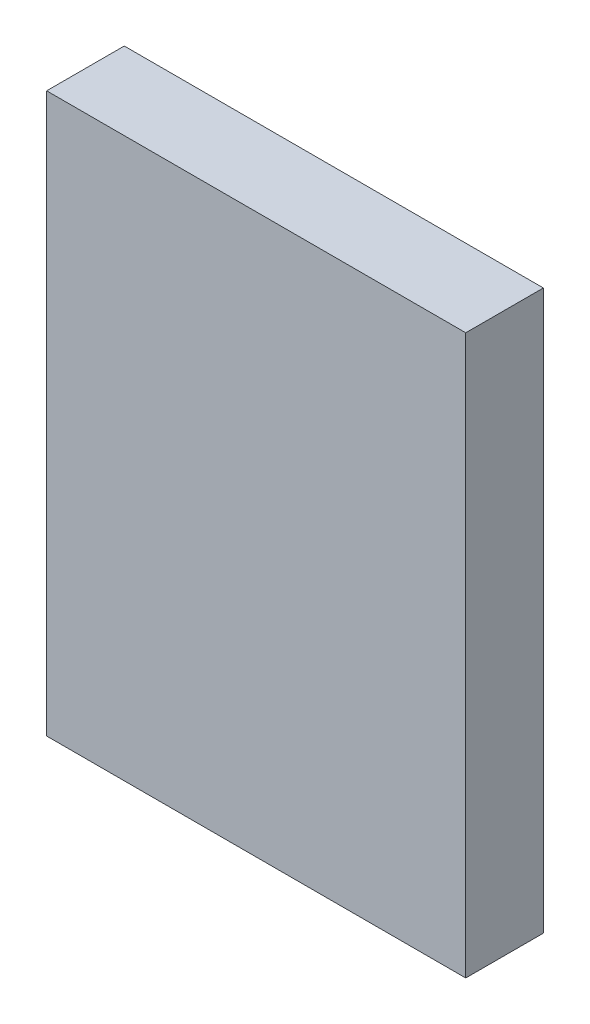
ISO-10303-21;
HEADER;
FILE_DESCRIPTION(('STEP AP214'),'2;1');
FILE_NAME('part.step','',(''),(''),'','','');
FILE_SCHEMA(('AUTOMOTIVE_DESIGN { 1 0 10303 214 1 1 1 1 }'));
ENDSEC;
DATA;
#1=APPLICATION_CONTEXT('core data for automotive mechanical design processes');
#2=APPLICATION_PROTOCOL_DEFINITION('international standard','automotive_design',2000,#1);
#3=PRODUCT_CONTEXT('',#1,'mechanical');
#4=PRODUCT('Part','Part','',(#3));
#5=PRODUCT_RELATED_PRODUCT_CATEGORY('part','',(#4));
#6=PRODUCT_DEFINITION_FORMATION('','',#4);
#7=PRODUCT_DEFINITION_CONTEXT('part definition',#1,'design');
#8=PRODUCT_DEFINITION('design','',#6,#7);
#9=PRODUCT_DEFINITION_SHAPE('','',#8);
#10=(LENGTH_UNIT() NAMED_UNIT(*) SI_UNIT(.MILLI.,.METRE.));
#11=(NAMED_UNIT(*) PLANE_ANGLE_UNIT() SI_UNIT($,.RADIAN.));
#12=(NAMED_UNIT(*) SI_UNIT($,.STERADIAN.) SOLID_ANGLE_UNIT());
#13=UNCERTAINTY_MEASURE_WITH_UNIT(LENGTH_MEASURE(1.E-05),#10,'distance_accuracy_value','');
#14=(GEOMETRIC_REPRESENTATION_CONTEXT(3) GLOBAL_UNCERTAINTY_ASSIGNED_CONTEXT((#13)) GLOBAL_UNIT_ASSIGNED_CONTEXT((#10,
#11,#12)) REPRESENTATION_CONTEXT('',''));
#15=CARTESIAN_POINT('',(0.,0.,0.));
#16=DIRECTION('',(0.,0.,1.));
#17=DIRECTION('',(1.,0.,0.));
#18=AXIS2_PLACEMENT_3D('',#15,#16,#17);
#19=CARTESIAN_POINT('',(-13.5,18.,5.));
#20=DIRECTION('',(1.,0.,0.));
#21=DIRECTION('',(0.,1.,0.));
#22=AXIS2_PLACEMENT_3D('',#19,#20,#21);
#23=PLANE('',#22);
#24=DIRECTION('',(0.,-1.,0.));
#25=VECTOR('',#24,1.);
#26=CARTESIAN_POINT('',(-13.5,18.,0.));
#27=LINE('',#26,#25);
#28=CARTESIAN_POINT('',(-13.5,18.,0.));
#29=VERTEX_POINT('',#28);
#30=CARTESIAN_POINT('',(-13.5,-18.,0.));
#31=VERTEX_POINT('',#30);
#32=EDGE_CURVE('E97',#29,#31,#27,.T.);
#33=ORIENTED_EDGE('',*,*,#32,.T.);
#34=DIRECTION('',(0.,0.,-1.));
#35=VECTOR('',#34,1.);
#36=CARTESIAN_POINT('',(-13.5,-18.,5.));
#37=LINE('',#36,#35);
#38=CARTESIAN_POINT('',(-13.5,-18.,5.));
#39=VERTEX_POINT('',#38);
#40=EDGE_CURVE('E11',#39,#31,#37,.T.);
#41=ORIENTED_EDGE('',*,*,#40,.F.);
#42=DIRECTION('',(0.,-1.,0.));
#43=VECTOR('',#42,1.);
#44=CARTESIAN_POINT('',(-13.5,18.,5.));
#45=LINE('',#44,#43);
#46=CARTESIAN_POINT('',(-13.5,18.,5.));
#47=VERTEX_POINT('',#46);
#48=EDGE_CURVE('E85',#47,#39,#45,.T.);
#49=ORIENTED_EDGE('',*,*,#48,.F.);
#50=DIRECTION('',(0.,0.,-1.));
#51=VECTOR('',#50,1.);
#52=CARTESIAN_POINT('',(-13.5,18.,5.));
#53=LINE('',#52,#51);
#54=EDGE_CURVE('E93',#47,#29,#53,.T.);
#55=ORIENTED_EDGE('',*,*,#54,.T.);
#56=EDGE_LOOP('',(#33,#41,#49,#55));
#57=FACE_BOUND('',#56,.T.);
#58=ADVANCED_FACE('F34',(#57),#23,.F.);
#59=CARTESIAN_POINT('',(-13.5,-18.,5.));
#60=DIRECTION('',(0.,1.,0.));
#61=DIRECTION('',(0.,0.,1.));
#62=AXIS2_PLACEMENT_3D('',#59,#60,#61);
#63=PLANE('',#62);
#64=DIRECTION('',(1.,0.,0.));
#65=VECTOR('',#64,1.);
#66=CARTESIAN_POINT('',(-13.5,-18.,0.));
#67=LINE('',#66,#65);
#68=CARTESIAN_POINT('',(13.5,-18.,0.));
#69=VERTEX_POINT('',#68);
#70=EDGE_CURVE('E89',#31,#69,#67,.T.);
#71=ORIENTED_EDGE('',*,*,#70,.T.);
#72=DIRECTION('',(0.,0.,-1.));
#73=VECTOR('',#72,1.);
#74=CARTESIAN_POINT('',(13.5,-18.,5.));
#75=LINE('',#74,#73);
#76=CARTESIAN_POINT('',(13.5,-18.,5.));
#77=VERTEX_POINT('',#76);
#78=EDGE_CURVE('E42',#77,#69,#75,.T.);
#79=ORIENTED_EDGE('',*,*,#78,.F.);
#80=DIRECTION('',(1.,0.,0.));
#81=VECTOR('',#80,1.);
#82=CARTESIAN_POINT('',(-13.5,-18.,5.));
#83=LINE('',#82,#81);
#84=EDGE_CURVE('E80',#39,#77,#83,.T.);
#85=ORIENTED_EDGE('',*,*,#84,.F.);
#86=ORIENTED_EDGE('',*,*,#40,.T.);
#87=EDGE_LOOP('',(#71,#79,#85,#86));
#88=FACE_BOUND('',#87,.T.);
#89=ADVANCED_FACE('F88',(#88),#63,.F.);
#90=CARTESIAN_POINT('',(13.5,18.,5.));
#91=DIRECTION('',(-1.,0.,0.));
#92=DIRECTION('',(0.,-1.,0.));
#93=AXIS2_PLACEMENT_3D('',#90,#91,#92);
#94=PLANE('',#93);
#95=DIRECTION('',(0.,1.,0.));
#96=VECTOR('',#95,1.);
#97=CARTESIAN_POINT('',(13.5,18.,0.));
#98=LINE('',#97,#96);
#99=CARTESIAN_POINT('',(13.5,18.,0.));
#100=VERTEX_POINT('',#99);
#101=EDGE_CURVE('E67',#69,#100,#98,.T.);
#102=ORIENTED_EDGE('',*,*,#101,.T.);
#103=DIRECTION('',(0.,0.,-1.));
#104=VECTOR('',#103,1.);
#105=CARTESIAN_POINT('',(13.5,18.,5.));
#106=LINE('',#105,#104);
#107=CARTESIAN_POINT('',(13.5,18.,5.));
#108=VERTEX_POINT('',#107);
#109=EDGE_CURVE('E90',#108,#100,#106,.T.);
#110=ORIENTED_EDGE('',*,*,#109,.F.);
#111=DIRECTION('',(0.,1.,0.));
#112=VECTOR('',#111,1.);
#113=CARTESIAN_POINT('',(13.5,18.,5.));
#114=LINE('',#113,#112);
#115=EDGE_CURVE('E83',#77,#108,#114,.T.);
#116=ORIENTED_EDGE('',*,*,#115,.F.);
#117=ORIENTED_EDGE('',*,*,#78,.T.);
#118=EDGE_LOOP('',(#102,#110,#116,#117));
#119=FACE_BOUND('',#118,.T.);
#120=ADVANCED_FACE('F91',(#119),#94,.F.);
#121=CARTESIAN_POINT('',(-13.5,18.,5.));
#122=DIRECTION('',(0.,-1.,0.));
#123=DIRECTION('',(0.,0.,-1.));
#124=AXIS2_PLACEMENT_3D('',#121,#122,#123);
#125=PLANE('',#124);
#126=DIRECTION('',(-1.,0.,0.));
#127=VECTOR('',#126,1.);
#128=CARTESIAN_POINT('',(-13.5,18.,0.));
#129=LINE('',#128,#127);
#130=EDGE_CURVE('E73',#100,#29,#129,.T.);
#131=ORIENTED_EDGE('',*,*,#130,.T.);
#132=ORIENTED_EDGE('',*,*,#54,.F.);
#133=DIRECTION('',(-1.,0.,0.));
#134=VECTOR('',#133,1.);
#135=CARTESIAN_POINT('',(-13.5,18.,5.));
#136=LINE('',#135,#134);
#137=EDGE_CURVE('E50',#108,#47,#136,.T.);
#138=ORIENTED_EDGE('',*,*,#137,.F.);
#139=ORIENTED_EDGE('',*,*,#109,.T.);
#140=EDGE_LOOP('',(#131,#132,#138,#139));
#141=FACE_BOUND('',#140,.T.);
#142=ADVANCED_FACE('F104',(#141),#125,.F.);
#143=CARTESIAN_POINT('',(-13.5,-18.,5.));
#144=DIRECTION('',(0.,0.,1.));
#145=DIRECTION('',(1.,0.,0.));
#146=AXIS2_PLACEMENT_3D('',#143,#144,#145);
#147=PLANE('',#146);
#148=ORIENTED_EDGE('',*,*,#48,.T.);
#149=ORIENTED_EDGE('',*,*,#84,.T.);
#150=ORIENTED_EDGE('',*,*,#115,.T.);
#151=ORIENTED_EDGE('',*,*,#137,.T.);
#152=EDGE_LOOP('',(#148,#149,#150,#151));
#153=FACE_BOUND('',#152,.T.);
#154=ADVANCED_FACE('F81',(#153),#147,.T.);
#155=CARTESIAN_POINT('',(-13.5,-18.,0.));
#156=DIRECTION('',(0.,0.,1.));
#157=DIRECTION('',(1.,0.,0.));
#158=AXIS2_PLACEMENT_3D('',#155,#156,#157);
#159=PLANE('',#158);
#160=ORIENTED_EDGE('',*,*,#32,.F.);
#161=ORIENTED_EDGE('',*,*,#130,.F.);
#162=ORIENTED_EDGE('',*,*,#101,.F.);
#163=ORIENTED_EDGE('',*,*,#70,.F.);
#164=EDGE_LOOP('',(#160,#161,#162,#163));
#165=FACE_BOUND('',#164,.T.);
#166=ADVANCED_FACE('F107',(#165),#159,.F.);
#167=CLOSED_SHELL('',(#58,#89,#120,#142,#154,#166));
#168=MANIFOLD_SOLID_BREP('B2',#167);
#169=ADVANCED_BREP_SHAPE_REPRESENTATION('',(#18,#168),#14);
#170=SHAPE_DEFINITION_REPRESENTATION(#9,#169);
ENDSEC;
END-ISO-10303-21;
